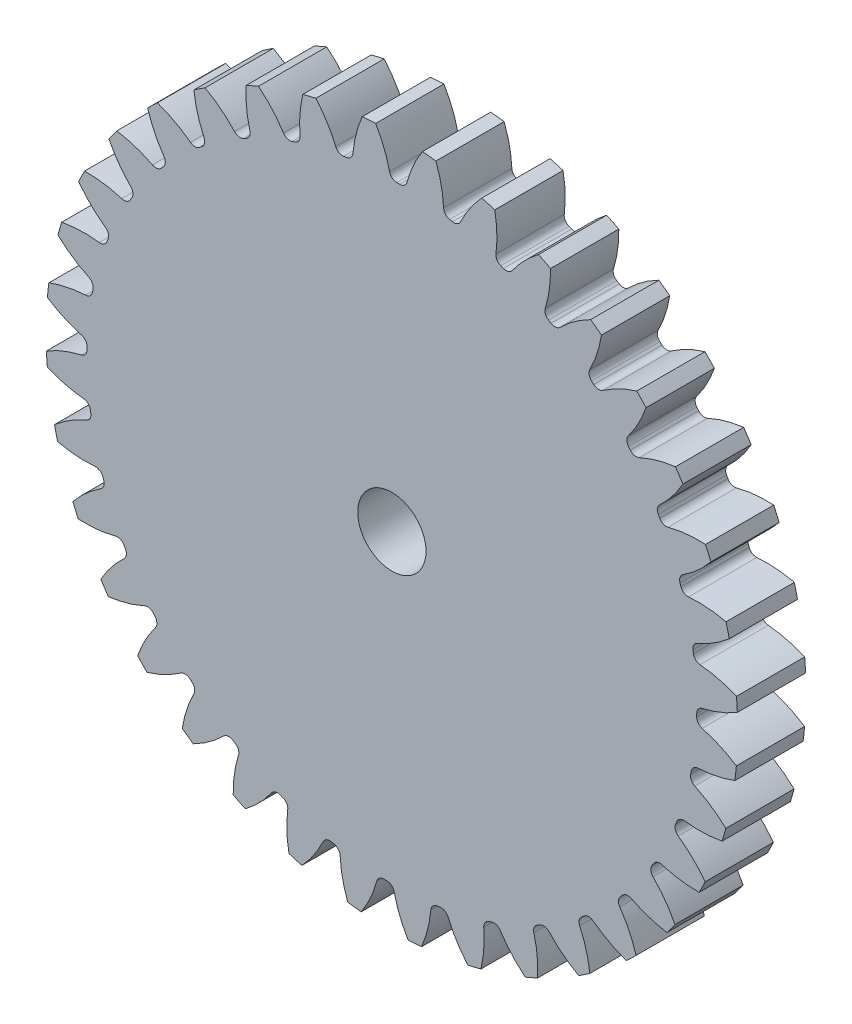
from build123d import *

# Parameters (mm, degrees)
SKETCH3_R         = 643.466666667
GEARBODY_DEPTH    = 127
TOOTHCUT_DEPTH    = 919.818644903
CIRPATTERN1_COUNT = 36
BOREDIA_R         = 63.5
BORE_DEPTH        = 12700


with BuildPart() as part:
    # Sketch3 → gearBody (new body)
    with BuildSketch(Plane.XY):
        Circle(SKETCH3_R)
    extrude(amount=GEARBODY_DEPTH)

    # Sketch2 → toothCut (cut, through all)
    with BuildSketch(Plane.XY):
        with BuildLine():
            ThreePointArc((567.080409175, -14.535495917), (567.143936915, -11.799403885), (567.19426343, -9.063037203))
            ThreePointArc((567.19426343, -9.063037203), (570.276069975, -0.594313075), (577.931946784, 4.160092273))
            ThreePointArc((577.931946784, 4.160092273), (611.765993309, 14.743872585), (643.466666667, 30.612912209))
            ThreePointArc((643.466666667, 30.612912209), (644.055086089, -13.399536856), (641.636614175, -57.349427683))
            ThreePointArc((641.636614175, -57.349427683), (610.623395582, -40.175628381), (577.258825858, -28.193783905))
            ThreePointArc((577.258825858, -28.193783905), (569.807318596, -23.125070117), (567.080409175, -14.535495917))
        make_face()
    toothcut = extrude(amount=TOOTHCUT_DEPTH, mode=Mode.SUBTRACT)

    # CirPattern1: toothCut ×36 about axis
    cirpattern1_axis = Axis((0, 0, 0), (0, 0, 1))
    for i in range(1, CIRPATTERN1_COUNT):
        add(toothcut.rotate(cirpattern1_axis, i * 360 / CIRPATTERN1_COUNT), mode=Mode.SUBTRACT)

    # boreDia → bore (cut, symmetric)
    with BuildSketch(Plane.XY):
        Circle(BOREDIA_R)
    extrude(amount=BORE_DEPTH, both=True, mode=Mode.SUBTRACT)


solid = part.part
